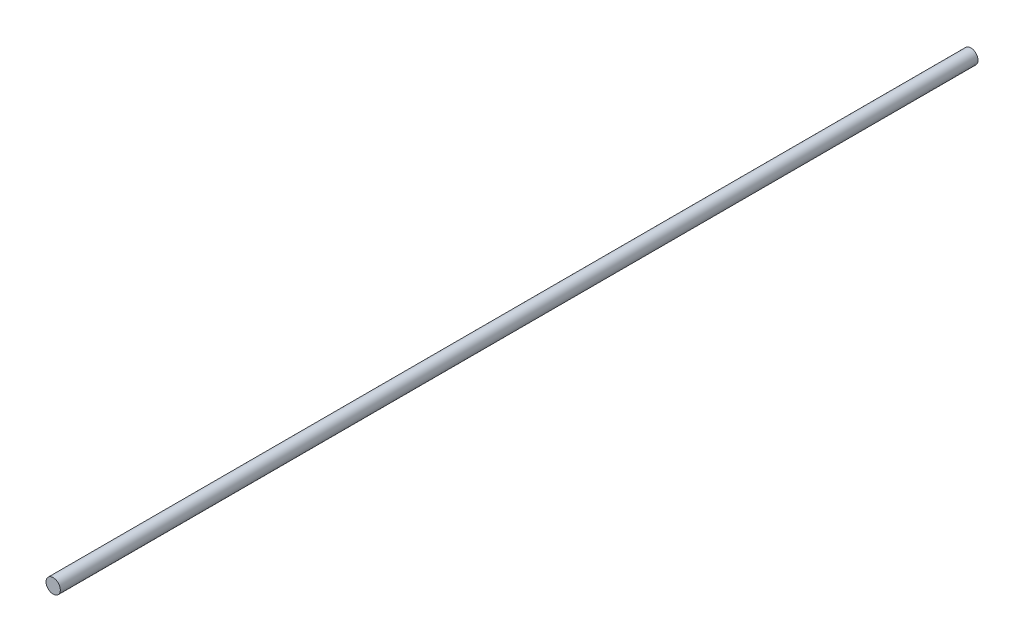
from build123d import *

# Parameters (mm, degrees)
SKETCH1_R      = 4.7625
EXTRUDE1_DEPTH = 609.6


with BuildPart() as part:
    # Sketch1 → Extrude1 (new body)
    with BuildSketch(Plane.XY):
        with Locations(Location((0, 0, 0), (0, 0, 180))):
            Circle(SKETCH1_R)
    extrude(amount=EXTRUDE1_DEPTH)


solid = part.part
